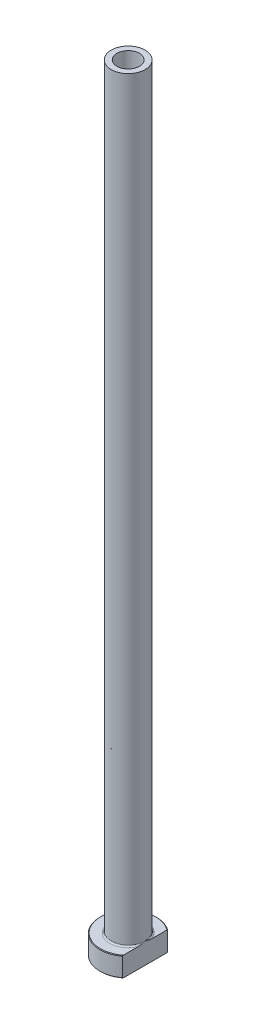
ISO-10303-21;
HEADER;
FILE_DESCRIPTION(('STEP AP214'),'2;1');
FILE_NAME('part.step','',(''),(''),'','','');
FILE_SCHEMA(('AUTOMOTIVE_DESIGN { 1 0 10303 214 1 1 1 1 }'));
ENDSEC;
DATA;
#1=APPLICATION_CONTEXT('core data for automotive mechanical design processes');
#2=APPLICATION_PROTOCOL_DEFINITION('international standard','automotive_design',2000,#1);
#3=PRODUCT_CONTEXT('',#1,'mechanical');
#4=PRODUCT('Part','Part','',(#3));
#5=PRODUCT_RELATED_PRODUCT_CATEGORY('part','',(#4));
#6=PRODUCT_DEFINITION_FORMATION('','',#4);
#7=PRODUCT_DEFINITION_CONTEXT('part definition',#1,'design');
#8=PRODUCT_DEFINITION('design','',#6,#7);
#9=PRODUCT_DEFINITION_SHAPE('','',#8);
#10=(LENGTH_UNIT() NAMED_UNIT(*) SI_UNIT(.MILLI.,.METRE.));
#11=(NAMED_UNIT(*) PLANE_ANGLE_UNIT() SI_UNIT($,.RADIAN.));
#12=(NAMED_UNIT(*) SI_UNIT($,.STERADIAN.) SOLID_ANGLE_UNIT());
#13=UNCERTAINTY_MEASURE_WITH_UNIT(LENGTH_MEASURE(1.E-05),#10,'distance_accuracy_value','');
#14=(GEOMETRIC_REPRESENTATION_CONTEXT(3) GLOBAL_UNCERTAINTY_ASSIGNED_CONTEXT((#13)) GLOBAL_UNIT_ASSIGNED_CONTEXT((#10,
#11,#12)) REPRESENTATION_CONTEXT('',''));
#15=CARTESIAN_POINT('',(0.,0.,0.));
#16=DIRECTION('',(0.,0.,1.));
#17=DIRECTION('',(1.,0.,0.));
#18=AXIS2_PLACEMENT_3D('',#15,#16,#17);
#19=CARTESIAN_POINT('',(0.,92.1876809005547,0.));
#20=DIRECTION('',(0.,1.,0.));
#21=DIRECTION('',(0.,0.,1.));
#22=AXIS2_PLACEMENT_3D('',#19,#20,#21);
#23=CYLINDRICAL_SURFACE('',#22,4.00000000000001);
#24=CARTESIAN_POINT('',(0.,275.,0.));
#25=DIRECTION('',(0.,1.,0.));
#26=DIRECTION('',(0.,0.,1.));
#27=AXIS2_PLACEMENT_3D('',#24,#25,#26);
#28=CIRCLE('',#27,4.00000000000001);
#29=CARTESIAN_POINT('',(0.,275.,4.00000000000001));
#30=VERTEX_POINT('',#29);
#31=EDGE_CURVE('E167',#30,#30,#28,.T.);
#32=ORIENTED_EDGE('',*,*,#31,.T.);
#33=EDGE_LOOP('',(#32));
#34=FACE_BOUND('',#33,.T.);
#35=CARTESIAN_POINT('',(0.,230.,0.));
#36=DIRECTION('',(0.,1.,0.));
#37=DIRECTION('',(0.,0.,1.));
#38=AXIS2_PLACEMENT_3D('',#35,#36,#37);
#39=CIRCLE('',#38,4.00000000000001);
#40=CARTESIAN_POINT('',(0.,230.,4.00000000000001));
#41=VERTEX_POINT('',#40);
#42=EDGE_CURVE('E170',#41,#41,#39,.T.);
#43=ORIENTED_EDGE('',*,*,#42,.F.);
#44=EDGE_LOOP('',(#43));
#45=FACE_BOUND('',#44,.T.);
#46=ADVANCED_FACE('F32',(#34,#45),#23,.F.);
#47=CARTESIAN_POINT('',(-4.00000000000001,275.,0.));
#48=DIRECTION('',(0.,1.,0.));
#49=DIRECTION('',(0.,0.,1.));
#50=AXIS2_PLACEMENT_3D('',#47,#48,#49);
#51=PLANE('',#50);
#52=CARTESIAN_POINT('',(0.,275.,0.));
#53=DIRECTION('',(0.,1.,0.));
#54=DIRECTION('',(0.,0.,1.));
#55=AXIS2_PLACEMENT_3D('',#52,#53,#54);
#56=CIRCLE('',#55,6.00000000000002);
#57=CARTESIAN_POINT('',(0.,275.,6.00000000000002));
#58=VERTEX_POINT('',#57);
#59=EDGE_CURVE('E174',#58,#58,#56,.T.);
#60=ORIENTED_EDGE('',*,*,#59,.T.);
#61=EDGE_LOOP('',(#60));
#62=FACE_BOUND('',#61,.T.);
#63=ORIENTED_EDGE('',*,*,#31,.F.);
#64=EDGE_LOOP('',(#63));
#65=FACE_BOUND('',#64,.T.);
#66=ADVANCED_FACE('F157',(#62,#65),#51,.T.);
#67=CARTESIAN_POINT('',(0.,92.1876809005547,0.));
#68=DIRECTION('',(0.,1.,0.));
#69=DIRECTION('',(0.,0.,1.));
#70=AXIS2_PLACEMENT_3D('',#67,#68,#69);
#71=CYLINDRICAL_SURFACE('',#70,6.00000000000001);
#72=CARTESIAN_POINT('',(0.,7.50000000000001,0.));
#73=DIRECTION('',(0.,1.,0.));
#74=DIRECTION('',(0.,0.,1.));
#75=AXIS2_PLACEMENT_3D('',#72,#73,#74);
#76=CIRCLE('',#75,6.00000000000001);
#77=CARTESIAN_POINT('',(6.,7.50000000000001,0.));
#78=VERTEX_POINT('',#77);
#79=EDGE_CURVE('E180',#78,#78,#76,.T.);
#80=ORIENTED_EDGE('',*,*,#79,.T.);
#81=EDGE_LOOP('',(#80));
#82=FACE_BOUND('',#81,.T.);
#83=ORIENTED_EDGE('',*,*,#59,.F.);
#84=EDGE_LOOP('',(#83));
#85=FACE_BOUND('',#84,.T.);
#86=ADVANCED_FACE('F162',(#82,#85),#71,.T.);
#87=CARTESIAN_POINT('',(-5.99999999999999,7.,0.));
#88=DIRECTION('',(0.,1.,0.));
#89=DIRECTION('',(0.,0.,1.));
#90=AXIS2_PLACEMENT_3D('',#87,#88,#89);
#91=PLANE('',#90);
#92=DIRECTION('',(0.,0.,1.));
#93=VECTOR('',#92,1.);
#94=CARTESIAN_POINT('',(6.,7.,0.));
#95=LINE('',#94,#93);
#96=CARTESIAN_POINT('',(6.,7.,-7.74854825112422));
#97=VERTEX_POINT('',#96);
#98=CARTESIAN_POINT('',(6.,7.,-2.50000000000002));
#99=VERTEX_POINT('',#98);
#100=EDGE_CURVE('E54',#97,#99,#95,.T.);
#101=ORIENTED_EDGE('',*,*,#100,.F.);
#102=CARTESIAN_POINT('',(0.,7.,0.));
#103=DIRECTION('',(0.,1.,0.));
#104=DIRECTION('',(0.,0.,1.));
#105=AXIS2_PLACEMENT_3D('',#102,#103,#104);
#106=CIRCLE('',#105,9.80000000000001);
#107=CARTESIAN_POINT('',(5.99999999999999,7.,7.74854825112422));
#108=VERTEX_POINT('',#107);
#109=EDGE_CURVE('E186',#97,#108,#106,.T.);
#110=ORIENTED_EDGE('',*,*,#109,.T.);
#111=CARTESIAN_POINT('',(6.,7.,2.50000000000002));
#112=VERTEX_POINT('',#111);
#113=EDGE_CURVE('E134',#112,#108,#95,.T.);
#114=ORIENTED_EDGE('',*,*,#113,.F.);
#115=CARTESIAN_POINT('',(0.,7.,0.));
#116=DIRECTION('',(0.,1.,0.));
#117=DIRECTION('',(0.,0.,1.));
#118=AXIS2_PLACEMENT_3D('',#115,#116,#117);
#119=CIRCLE('',#118,6.50000000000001);
#120=EDGE_CURVE('E183',#112,#99,#119,.F.);
#121=ORIENTED_EDGE('',*,*,#120,.T.);
#122=EDGE_LOOP('',(#101,#110,#114,#121));
#123=FACE_BOUND('',#122,.T.);
#124=ADVANCED_FACE('F197',(#123),#91,.T.);
#125=CARTESIAN_POINT('',(0.,92.1876809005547,0.));
#126=DIRECTION('',(0.,1.,0.));
#127=DIRECTION('',(0.,0.,1.));
#128=AXIS2_PLACEMENT_3D('',#125,#126,#127);
#129=CYLINDRICAL_SURFACE('',#128,9.99999999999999);
#130=DIRECTION('',(0.,-1.,0.));
#131=VECTOR('',#130,1.);
#132=CARTESIAN_POINT('',(5.99999999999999,275.,7.99999999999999));
#133=LINE('',#132,#131);
#134=CARTESIAN_POINT('',(5.99999999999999,6.80000000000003,7.99999999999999));
#135=VERTEX_POINT('',#134);
#136=CARTESIAN_POINT('',(5.99999999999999,0.200000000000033,7.99999999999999));
#137=VERTEX_POINT('',#136);
#138=EDGE_CURVE('E82',#135,#137,#133,.T.);
#139=ORIENTED_EDGE('',*,*,#138,.F.);
#140=CARTESIAN_POINT('',(0.,6.80000000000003,0.));
#141=DIRECTION('',(0.,1.,0.));
#142=DIRECTION('',(0.,0.,1.));
#143=AXIS2_PLACEMENT_3D('',#140,#141,#142);
#144=CIRCLE('',#143,9.99999999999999);
#145=CARTESIAN_POINT('',(6.,6.80000000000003,-7.99999999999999));
#146=VERTEX_POINT('',#145);
#147=EDGE_CURVE('E95',#135,#146,#144,.F.);
#148=ORIENTED_EDGE('',*,*,#147,.T.);
#149=DIRECTION('',(0.,-1.,0.));
#150=VECTOR('',#149,1.);
#151=CARTESIAN_POINT('',(6.,275.,-7.99999999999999));
#152=LINE('',#151,#150);
#153=CARTESIAN_POINT('',(6.,0.200000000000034,-7.99999999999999));
#154=VERTEX_POINT('',#153);
#155=EDGE_CURVE('E192',#146,#154,#152,.T.);
#156=ORIENTED_EDGE('',*,*,#155,.T.);
#157=CARTESIAN_POINT('',(0.,0.200000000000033,0.));
#158=DIRECTION('',(0.,-1.,0.));
#159=DIRECTION('',(0.,0.,-1.));
#160=AXIS2_PLACEMENT_3D('',#157,#158,#159);
#161=CIRCLE('',#160,9.99999999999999);
#162=EDGE_CURVE('E98',#154,#137,#161,.F.);
#163=ORIENTED_EDGE('',*,*,#162,.T.);
#164=EDGE_LOOP('',(#139,#148,#156,#163));
#165=FACE_BOUND('',#164,.T.);
#166=ADVANCED_FACE('F190',(#165),#129,.T.);
#167=CARTESIAN_POINT('',(-9.99999999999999,0.,0.));
#168=DIRECTION('',(0.,-1.,0.));
#169=DIRECTION('',(0.,0.,-1.));
#170=AXIS2_PLACEMENT_3D('',#167,#168,#169);
#171=PLANE('',#170);
#172=CARTESIAN_POINT('',(0.,0.,0.));
#173=DIRECTION('',(0.,-1.,0.));
#174=DIRECTION('',(0.,0.,-1.));
#175=AXIS2_PLACEMENT_3D('',#172,#173,#174);
#176=CIRCLE('',#175,4.75);
#177=CARTESIAN_POINT('',(0.,0.,-4.75));
#178=VERTEX_POINT('',#177);
#179=EDGE_CURVE('E40',#178,#178,#176,.F.);
#180=ORIENTED_EDGE('',*,*,#179,.T.);
#181=EDGE_LOOP('',(#180));
#182=FACE_BOUND('',#181,.T.);
#183=DIRECTION('',(0.,0.,-1.));
#184=VECTOR('',#183,1.);
#185=CARTESIAN_POINT('',(5.99999999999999,0.,7.99999999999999));
#186=LINE('',#185,#184);
#187=CARTESIAN_POINT('',(5.99999999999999,0.,7.74854825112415));
#188=VERTEX_POINT('',#187);
#189=CARTESIAN_POINT('',(6.,0.,-7.74854825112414));
#190=VERTEX_POINT('',#189);
#191=EDGE_CURVE('E47',#188,#190,#186,.T.);
#192=ORIENTED_EDGE('',*,*,#191,.F.);
#193=CARTESIAN_POINT('',(0.,0.,0.));
#194=DIRECTION('',(0.,-1.,0.));
#195=DIRECTION('',(0.,0.,-1.));
#196=AXIS2_PLACEMENT_3D('',#193,#194,#195);
#197=CIRCLE('',#196,9.79999999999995);
#198=EDGE_CURVE('E92',#188,#190,#197,.T.);
#199=ORIENTED_EDGE('',*,*,#198,.T.);
#200=EDGE_LOOP('',(#192,#199));
#201=FACE_BOUND('',#200,.T.);
#202=ADVANCED_FACE('F91',(#182,#201),#171,.T.);
#203=CARTESIAN_POINT('',(0.,92.1876809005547,0.));
#204=DIRECTION('',(0.,1.,0.));
#205=DIRECTION('',(0.,0.,1.));
#206=AXIS2_PLACEMENT_3D('',#203,#204,#205);
#207=CYLINDRICAL_SURFACE('',#206,4.25);
#208=CARTESIAN_POINT('',(0.,0.499999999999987,0.));
#209=DIRECTION('',(0.,-1.,0.));
#210=DIRECTION('',(0.,0.,-1.));
#211=AXIS2_PLACEMENT_3D('',#208,#209,#210);
#212=CIRCLE('',#211,4.25);
#213=CARTESIAN_POINT('',(0.,0.499999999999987,-4.25));
#214=VERTEX_POINT('',#213);
#215=EDGE_CURVE('E11',#214,#214,#212,.T.);
#216=ORIENTED_EDGE('',*,*,#215,.T.);
#217=EDGE_LOOP('',(#216));
#218=FACE_BOUND('',#217,.T.);
#219=CARTESIAN_POINT('',(0.,218.,0.));
#220=DIRECTION('',(0.,1.,0.));
#221=DIRECTION('',(0.,0.,1.));
#222=AXIS2_PLACEMENT_3D('',#219,#220,#221);
#223=CIRCLE('',#222,4.25000000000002);
#224=CARTESIAN_POINT('',(0.,218.,4.25000000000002));
#225=VERTEX_POINT('',#224);
#226=EDGE_CURVE('E172',#225,#225,#223,.T.);
#227=ORIENTED_EDGE('',*,*,#226,.T.);
#228=EDGE_LOOP('',(#227));
#229=FACE_BOUND('',#228,.T.);
#230=ADVANCED_FACE('F215',(#218,#229),#207,.F.);
#231=CARTESIAN_POINT('',(0.,218.,0.));
#232=DIRECTION('',(0.,-1.,0.));
#233=DIRECTION('',(0.,0.,-1.));
#234=AXIS2_PLACEMENT_3D('',#231,#232,#233);
#235=CONICAL_SURFACE('',#234,4.25000000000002,0.0208303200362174);
#236=ORIENTED_EDGE('',*,*,#42,.T.);
#237=EDGE_LOOP('',(#236));
#238=FACE_BOUND('',#237,.T.);
#239=ORIENTED_EDGE('',*,*,#226,.F.);
#240=EDGE_LOOP('',(#239));
#241=FACE_BOUND('',#240,.T.);
#242=ADVANCED_FACE('F111',(#238,#241),#235,.F.);
#243=CARTESIAN_POINT('',(0.,7.50000000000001,0.));
#244=DIRECTION('',(0.,1.,0.));
#245=DIRECTION('',(0.,0.,1.));
#246=AXIS2_PLACEMENT_3D('',#243,#244,#245);
#247=TOROIDAL_SURFACE('',#246,6.50000000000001,0.5);
#248=ORIENTED_EDGE('',*,*,#120,.F.);
#249=CARTESIAN_POINT('',(6.,7.50000000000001,0.));
#250=CARTESIAN_POINT('',(6.,7.50000080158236,6.70589102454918E-11));
#251=CARTESIAN_POINT('',(6.,7.50000160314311,2.62462821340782E-07));
#252=CARTESIAN_POINT('',(6.,7.50000311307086,1.01907222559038E-06));
#253=CARTESIAN_POINT('',(6.,7.50000381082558,1.52837970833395E-06));
#254=CARTESIAN_POINT('',(6.,7.50000523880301,2.74467673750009E-06));
#255=CARTESIAN_POINT('',(6.,7.50000595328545,3.47066796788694E-06));
#256=CARTESIAN_POINT('',(6.,7.50000725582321,4.99336266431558E-06));
#257=CARTESIAN_POINT('',(6.,7.50000784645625,5.7880020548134E-06));
#258=CARTESIAN_POINT('',(6.,7.50000997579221,8.79661715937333E-06));
#259=CARTESIAN_POINT('',(6.,7.50001139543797,1.10980689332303E-05));
#260=CARTESIAN_POINT('',(6.,7.50001378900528,1.57116113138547E-05));
#261=CARTESIAN_POINT('',(6.,7.50001478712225,1.80117459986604E-05));
#262=CARTESIAN_POINT('',(6.,7.50001885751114,2.75423866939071E-05));
#263=CARTESIAN_POINT('',(6.,7.50002181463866,3.48285119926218E-05));
#264=CARTESIAN_POINT('',(6.,7.50002628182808,4.87408443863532E-05));
#265=CARTESIAN_POINT('',(6.,7.5000279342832,5.53214425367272E-05));
#266=CARTESIAN_POINT('',(6.,7.50003978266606,0.000103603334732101));
#267=CARTESIAN_POINT('',(6.,7.50004857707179,0.000145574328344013));
#268=CARTESIAN_POINT('',(5.99999999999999,7.50008704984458,0.00031069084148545));
#269=CARTESIAN_POINT('',(5.99999999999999,7.50012394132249,0.000432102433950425));
#270=CARTESIAN_POINT('',(6.,7.50026686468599,0.000911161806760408));
#271=CARTESIAN_POINT('',(6.,7.50036807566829,0.00126981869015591));
#272=CARTESIAN_POINT('',(5.99999999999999,7.5007719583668,0.00268961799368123));
#273=CARTESIAN_POINT('',(5.99999999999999,7.5010805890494,0.00374948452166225));
#274=CARTESIAN_POINT('',(6.,7.50236320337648,0.00816658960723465));
#275=CARTESIAN_POINT('',(6.,7.5033297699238,0.0115254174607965));
#276=CARTESIAN_POINT('',(5.99999999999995,7.51709821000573,0.0593544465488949));
#277=CARTESIAN_POINT('',(5.99999999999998,7.52995465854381,0.103813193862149));
#278=CARTESIAN_POINT('',(6.00000000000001,7.55506029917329,0.190977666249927));
#279=CARTESIAN_POINT('',(6.,7.56731321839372,0.233682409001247));
#280=CARTESIAN_POINT('',(5.99999999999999,7.59325665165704,0.32451250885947));
#281=CARTESIAN_POINT('',(5.99999999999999,7.60693346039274,0.372641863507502));
#282=CARTESIAN_POINT('',(6.,7.63422038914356,0.469489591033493));
#283=CARTESIAN_POINT('',(6.,7.64782813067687,0.518208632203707));
#284=CARTESIAN_POINT('',(6.,7.68043734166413,0.636338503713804));
#285=CARTESIAN_POINT('',(6.,7.69928754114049,0.705791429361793));
#286=CARTESIAN_POINT('',(6.,7.73566887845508,0.84310273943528));
#287=CARTESIAN_POINT('',(6.,7.75322160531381,0.910955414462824));
#288=CARTESIAN_POINT('',(6.,7.80024878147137,1.09857433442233));
#289=CARTESIAN_POINT('',(6.,7.82864900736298,1.21861610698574));
#290=CARTESIAN_POINT('',(6.,7.88105633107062,1.46081534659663));
#291=CARTESIAN_POINT('',(6.,7.90502088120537,1.58298212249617));
#292=CARTESIAN_POINT('',(6.,7.94810499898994,1.83866408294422));
#293=CARTESIAN_POINT('',(6.,7.96665856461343,1.9722808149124));
#294=CARTESIAN_POINT('',(6.,7.9862169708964,2.17329578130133));
#295=CARTESIAN_POINT('',(6.,7.99135613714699,2.24029152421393));
#296=CARTESIAN_POINT('',(6.,7.99832928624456,2.37444824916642));
#297=CARTESIAN_POINT('',(6.,8.00016429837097,2.4416091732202));
#298=CARTESIAN_POINT('',(6.,7.99984674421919,2.56298631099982));
#299=CARTESIAN_POINT('',(6.,7.99839439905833,2.61720324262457));
#300=CARTESIAN_POINT('',(6.,7.99236557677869,2.72552036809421));
#301=CARTESIAN_POINT('',(6.,7.98778645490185,2.77962042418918));
#302=CARTESIAN_POINT('',(6.,7.97492915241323,2.88664710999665));
#303=CARTESIAN_POINT('',(6.,7.96670262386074,2.93957965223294));
#304=CARTESIAN_POINT('',(6.,7.94570253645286,3.04448333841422));
#305=CARTESIAN_POINT('',(6.,7.93293488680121,3.09645563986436));
#306=CARTESIAN_POINT('',(6.,7.90135968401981,3.19943606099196));
#307=CARTESIAN_POINT('',(6.,7.8824717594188,3.25042120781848));
#308=CARTESIAN_POINT('',(6.,7.84818685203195,3.3240378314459));
#309=CARTESIAN_POINT('',(6.,7.8357905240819,3.34806431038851));
#310=CARTESIAN_POINT('',(6.,7.80866016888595,3.39474488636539));
#311=CARTESIAN_POINT('',(6.,7.79392968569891,3.41740099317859));
#312=CARTESIAN_POINT('',(6.,7.76577135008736,3.45524173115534));
#313=CARTESIAN_POINT('',(6.,7.75294719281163,3.47087266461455));
#314=CARTESIAN_POINT('',(6.,7.7255631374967,3.50058040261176));
#315=CARTESIAN_POINT('',(6.,7.71100204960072,3.5146561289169));
#316=CARTESIAN_POINT('',(6.,7.67984897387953,3.54077006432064));
#317=CARTESIAN_POINT('',(6.,7.66323651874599,3.55278430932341));
#318=CARTESIAN_POINT('',(6.,7.62815222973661,3.57370259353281));
#319=CARTESIAN_POINT('',(6.,7.60968501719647,3.58261412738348));
#320=CARTESIAN_POINT('',(6.,7.57639898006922,3.59454653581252));
#321=CARTESIAN_POINT('',(6.,7.56191673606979,3.59850385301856));
#322=CARTESIAN_POINT('',(6.,7.53249228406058,3.60392336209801));
#323=CARTESIAN_POINT('',(6.,7.51755044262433,3.60538749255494));
#324=CARTESIAN_POINT('',(6.,7.48761833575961,3.60568912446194));
#325=CARTESIAN_POINT('',(6.,7.47262803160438,3.60452285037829));
#326=CARTESIAN_POINT('',(6.,7.44306278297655,3.59966500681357));
#327=CARTESIAN_POINT('',(6.,7.42848812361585,3.59597174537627));
#328=CARTESIAN_POINT('',(6.,7.3970215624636,3.58531109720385));
#329=CARTESIAN_POINT('',(6.,7.38031267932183,3.5778073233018));
#330=CARTESIAN_POINT('',(6.,7.34834450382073,3.56018434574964));
#331=CARTESIAN_POINT('',(6.,7.33308764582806,3.55006085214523));
#332=CARTESIAN_POINT('',(6.,7.29715308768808,3.52252389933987));
#333=CARTESIAN_POINT('',(6.,7.27737832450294,3.50394102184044));
#334=CARTESIAN_POINT('',(6.,7.24088410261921,3.46399503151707));
#335=CARTESIAN_POINT('',(6.,7.22417302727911,3.44262455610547));
#336=CARTESIAN_POINT('',(6.,7.18148338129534,3.38088102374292));
#337=CARTESIAN_POINT('',(6.,7.15831783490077,3.33858120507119));
#338=CARTESIAN_POINT('',(6.,7.11822747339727,3.25128083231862));
#339=CARTESIAN_POINT('',(6.,7.10130560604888,3.20627901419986));
#340=CARTESIAN_POINT('',(6.,7.07193388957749,3.11375892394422));
#341=CARTESIAN_POINT('',(6.,7.05959256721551,3.06620687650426));
#342=CARTESIAN_POINT('',(6.,7.03888782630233,2.97022063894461));
#343=CARTESIAN_POINT('',(6.,7.03052890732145,2.92178551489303));
#344=CARTESIAN_POINT('',(6.,7.01697563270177,2.8237457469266));
#345=CARTESIAN_POINT('',(6.,7.01183067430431,2.77413446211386));
#346=CARTESIAN_POINT('',(6.,7.00435015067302,2.67475263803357));
#347=CARTESIAN_POINT('',(6.,7.00201229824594,2.62498226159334));
#348=CARTESIAN_POINT('',(6.,6.9989719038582,2.49377014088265));
#349=CARTESIAN_POINT('',(6.,7.00025005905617,2.41228296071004));
#350=CARTESIAN_POINT('',(6.,7.0077565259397,2.24952135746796));
#351=CARTESIAN_POINT('',(6.,7.01398784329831,2.16824709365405));
#352=CARTESIAN_POINT('',(6.,7.03045087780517,2.00575531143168));
#353=CARTESIAN_POINT('',(6.,7.04070001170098,1.92453960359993));
#354=CARTESIAN_POINT('',(6.,7.06442774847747,1.76257601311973));
#355=CARTESIAN_POINT('',(6.,7.07790697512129,1.68182822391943));
#356=CARTESIAN_POINT('',(6.,7.11973611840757,1.4539431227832));
#357=CARTESIAN_POINT('',(6.,7.15113840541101,1.30736987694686));
#358=CARTESIAN_POINT('',(6.,7.21927147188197,1.01717316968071));
#359=CARTESIAN_POINT('',(6.,7.25594155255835,0.873534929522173));
#360=CARTESIAN_POINT('',(6.,7.30765759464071,0.680321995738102));
#361=CARTESIAN_POINT('',(6.,7.32124979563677,0.630351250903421));
#362=CARTESIAN_POINT('',(6.,7.34913735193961,0.529103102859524));
#363=CARTESIAN_POINT('',(6.,7.36344174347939,0.477828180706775));
#364=CARTESIAN_POINT('',(6.,7.38809313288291,0.390268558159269));
#365=CARTESIAN_POINT('',(6.,7.39837954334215,0.353966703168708));
#366=CARTESIAN_POINT('',(6.,7.41893445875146,0.281778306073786));
#367=CARTESIAN_POINT('',(6.,7.42920197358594,0.245891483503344));
#368=CARTESIAN_POINT('',(5.99999999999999,7.4486400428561,0.178137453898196));
#369=CARTESIAN_POINT('',(5.99999999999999,7.45780513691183,0.14626862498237));
#370=CARTESIAN_POINT('',(6.,7.47656016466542,0.0812304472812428));
#371=CARTESIAN_POINT('',(6.00000000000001,7.48615204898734,0.0480615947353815));
#372=CARTESIAN_POINT('',(5.99999999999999,7.4966696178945,0.0115277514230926));
#373=CARTESIAN_POINT('',(5.99999999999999,7.49763547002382,0.00817123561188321));
#374=CARTESIAN_POINT('',(6.,7.49891791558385,0.00375466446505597));
#375=CARTESIAN_POINT('',(6.,7.49922706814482,0.00269301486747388));
#376=CARTESIAN_POINT('',(5.99999999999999,7.49963158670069,0.00127098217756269));
#377=CARTESIAN_POINT('',(5.99999999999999,7.49973292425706,0.000911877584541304));
#378=CARTESIAN_POINT('',(6.,7.49987600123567,0.000432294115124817));
#379=CARTESIAN_POINT('',(6.,7.49991291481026,0.000310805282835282));
#380=CARTESIAN_POINT('',(5.99999999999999,7.49995140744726,0.00014559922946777));
#381=CARTESIAN_POINT('',(5.99999999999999,7.49996020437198,0.000103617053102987));
#382=CARTESIAN_POINT('',(6.,7.49997205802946,5.53238244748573E-05));
#383=CARTESIAN_POINT('',(6.,7.49997371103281,4.87425723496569E-05));
#384=CARTESIAN_POINT('',(6.,7.49997817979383,3.48289280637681E-05));
#385=CARTESIAN_POINT('',(6.,7.49998113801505,2.75421791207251E-05));
#386=CARTESIAN_POINT('',(6.,7.49998520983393,1.80109018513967E-05));
#387=CARTESIAN_POINT('',(6.,7.49998620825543,1.57107180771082E-05));
#388=CARTESIAN_POINT('',(6.,7.49998860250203,1.10971303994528E-05));
#389=CARTESIAN_POINT('',(6.,7.49999002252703,8.79568794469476E-06));
#390=CARTESIAN_POINT('',(6.,7.49999215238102,5.78714778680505E-06));
#391=CARTESIAN_POINT('',(6.,7.49999274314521,4.9925443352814E-06));
#392=CARTESIAN_POINT('',(6.,7.49999404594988,3.46994517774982E-06));
#393=CARTESIAN_POINT('',(6.,7.49999476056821,2.74401420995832E-06));
#394=CARTESIAN_POINT('',(6.,7.49999618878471,1.52786018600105E-06));
#395=CARTESIAN_POINT('',(6.,7.49999688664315,1.01863063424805E-06));
#396=CARTESIAN_POINT('',(6.,7.49999839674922,2.6221568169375E-07));
#397=CARTESIAN_POINT('',(6.,7.49999919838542,-6.70603058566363E-11));
#398=CARTESIAN_POINT('',(6.,7.50000000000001,0.));
#399=B_SPLINE_CURVE_WITH_KNOTS('',3,(#249,#250,#251,#252,#253,#254,#255,#256,#257,#258,#259,
#260,#261,#262,#263,#264,#265,#266,#267,#268,#269,#270,#271,#272,#273,#274,#275,#276,#277,#278,
#279,#280,#281,#282,#283,#284,#285,#286,#287,#288,#289,#290,#291,#292,#293,#294,#295,#296,#297,
#298,#299,#300,#301,#302,#303,#304,#305,#306,#307,#308,#309,#310,#311,#312,#313,#314,#315,#316,
#317,#318,#319,#320,#321,#322,#323,#324,#325,#326,#327,#328,#329,#330,#331,#332,#333,#334,#335,
#336,#337,#338,#339,#340,#341,#342,#343,#344,#345,#346,#347,#348,#349,#350,#351,#352,#353,#354,
#355,#356,#357,#358,#359,#360,#361,#362,#363,#364,#365,#366,#367,#368,#369,#370,#371,#372,#373,
#374,#375,#376,#377,#378,#379,#380,#381,#382,#383,#384,#385,#386,#387,#388,#389,#390,#391,#392,
#393,#394,#395,#396,#397,#398),.UNSPECIFIED.,.T.,.F.,(4,2,2,2,2,2,2,2,2,2,2,2,2,2,2,2,2,2,2,2,2,
2,2,2,2,2,2,2,2,2,2,2,2,2,2,2,2,2,2,2,2,2,2,2,2,2,2,2,2,2,2,2,2,2,2,2,2,2,2,2,2,2,2,2,2,2,2,2,2,
2,2,2,2,2,4),(0.,2.41532791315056E-06,5.00161675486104E-06,8.04115813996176E-06,
1.10092294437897E-05,1.90889719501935E-05,2.66047346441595E-05,5.01454053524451E-05,
7.04739991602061E-05,0.000199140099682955,0.000579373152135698,0.00169781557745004,
0.00500893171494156,0.0154949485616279,0.154330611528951,0.287615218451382,0.437719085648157,
0.589470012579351,0.805361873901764,1.01561737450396,1.38561400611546,1.75899405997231,
2.16331287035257,2.3648290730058,2.56628249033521,2.72891861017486,2.89169246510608,
3.05223140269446,3.21256219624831,3.37509011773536,3.45609970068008,3.53698744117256,
3.59753760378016,3.65812948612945,3.71938396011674,3.7804894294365,3.82533702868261,
3.87014974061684,3.91502681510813,3.95993396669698,4.0145809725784,4.06931803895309,
4.15026803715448,4.23143634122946,4.37530581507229,4.51924312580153,4.66640085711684,
4.81372446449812,4.96325999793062,5.11267360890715,5.35695170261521,5.60137814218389,
5.84687607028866,6.09242144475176,6.54191534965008,6.98659302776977,7.14195169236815,
7.30164895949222,7.4148422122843,7.52682205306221,7.62630458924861,7.72988447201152,
7.74036324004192,7.743679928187,7.74479976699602,7.74518024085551,7.74530894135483,
7.74532927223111,7.74535281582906,7.7453603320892,7.7453684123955,7.74537138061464,
7.74537442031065,7.74537700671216,7.7453794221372),.UNSPECIFIED.);
#400=EDGE_CURVE('E126',#112,#78,#399,.T.);
#401=ORIENTED_EDGE('',*,*,#400,.T.);
#402=ORIENTED_EDGE('',*,*,#79,.F.);
#403=CARTESIAN_POINT('',(6.,7.50000000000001,0.));
#404=CARTESIAN_POINT('',(6.,7.49999919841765,-6.70573124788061E-11));
#405=CARTESIAN_POINT('',(6.,7.4999983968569,-2.62462819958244E-07));
#406=CARTESIAN_POINT('',(6.,7.49999688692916,-1.01907222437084E-06));
#407=CARTESIAN_POINT('',(6.,7.49999618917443,-1.52837970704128E-06));
#408=CARTESIAN_POINT('',(6.,7.499994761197,-2.74467673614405E-06));
#409=CARTESIAN_POINT('',(6.,7.49999404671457,-3.47066796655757E-06));
#410=CARTESIAN_POINT('',(6.,7.4999927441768,-4.99336266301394E-06));
#411=CARTESIAN_POINT('',(6.,7.49999215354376,-5.78800205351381E-06));
#412=CARTESIAN_POINT('',(6.,7.4999900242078,-8.79661715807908E-06));
#413=CARTESIAN_POINT('',(6.,7.49998860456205,-1.10980689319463E-05));
#414=CARTESIAN_POINT('',(6.,7.49998621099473,-1.57116113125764E-05));
#415=CARTESIAN_POINT('',(6.,7.49998521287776,-1.80117459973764E-05));
#416=CARTESIAN_POINT('',(6.,7.49998114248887,-2.75423866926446E-05));
#417=CARTESIAN_POINT('',(6.,7.49997818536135,-3.48285119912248E-05));
#418=CARTESIAN_POINT('',(6.,7.49997371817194,-4.87408443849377E-05));
#419=CARTESIAN_POINT('',(6.,7.49997206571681,-5.53214425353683E-05));
#420=CARTESIAN_POINT('',(5.99999999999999,7.49996021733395,-0.000103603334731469));
#421=CARTESIAN_POINT('',(5.99999999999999,7.49995142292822,-0.00014557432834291));
#422=CARTESIAN_POINT('',(6.,7.49991295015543,-0.000310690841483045));
#423=CARTESIAN_POINT('',(6.,7.49987605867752,-0.000432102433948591));
#424=CARTESIAN_POINT('',(5.99999999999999,7.49973313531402,-0.000911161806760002));
#425=CARTESIAN_POINT('',(5.99999999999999,7.49963192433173,-0.00126981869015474));
#426=CARTESIAN_POINT('',(6.,7.49922804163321,-0.00268961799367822));
#427=CARTESIAN_POINT('',(6.,7.49891941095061,-0.00374948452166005));
#428=CARTESIAN_POINT('',(5.99999999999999,7.49763679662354,-0.00816658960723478));
#429=CARTESIAN_POINT('',(5.99999999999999,7.49667023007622,-0.0115254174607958));
#430=CARTESIAN_POINT('',(6.00000000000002,7.48290178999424,-0.0593544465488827));
#431=CARTESIAN_POINT('',(6.,7.4700453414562,-0.103813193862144));
#432=CARTESIAN_POINT('',(5.99999999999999,7.44493970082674,-0.190977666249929));
#433=CARTESIAN_POINT('',(5.99999999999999,7.4326867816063,-0.233682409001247));
#434=CARTESIAN_POINT('',(6.,7.40674334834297,-0.32451250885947));
#435=CARTESIAN_POINT('',(6.,7.39306653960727,-0.372641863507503));
#436=CARTESIAN_POINT('',(6.,7.36577961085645,-0.469489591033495));
#437=CARTESIAN_POINT('',(6.,7.35217186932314,-0.518208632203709));
#438=CARTESIAN_POINT('',(6.,7.31956265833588,-0.636338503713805));
#439=CARTESIAN_POINT('',(6.,7.30071245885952,-0.705791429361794));
#440=CARTESIAN_POINT('',(6.,7.26433112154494,-0.84310273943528));
#441=CARTESIAN_POINT('',(6.,7.2467783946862,-0.910955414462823));
#442=CARTESIAN_POINT('',(6.,7.19975121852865,-1.09857433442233));
#443=CARTESIAN_POINT('',(6.,7.17135099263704,-1.21861610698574));
#444=CARTESIAN_POINT('',(6.,7.11894366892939,-1.46081534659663));
#445=CARTESIAN_POINT('',(6.,7.09497911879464,-1.58298212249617));
#446=CARTESIAN_POINT('',(6.,7.05189500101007,-1.83866408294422));
#447=CARTESIAN_POINT('',(6.,7.03334143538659,-1.9722808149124));
#448=CARTESIAN_POINT('',(6.,7.01378302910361,-2.17329578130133));
#449=CARTESIAN_POINT('',(6.,7.00864386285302,-2.24029152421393));
#450=CARTESIAN_POINT('',(6.,7.00167071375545,-2.37444824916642));
#451=CARTESIAN_POINT('',(6.,6.99983570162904,-2.4416091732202));
#452=CARTESIAN_POINT('',(6.,7.00015325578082,-2.56298631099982));
#453=CARTESIAN_POINT('',(6.,7.00160560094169,-2.61720324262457));
#454=CARTESIAN_POINT('',(6.,7.00763442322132,-2.72552036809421));
#455=CARTESIAN_POINT('',(6.,7.01221354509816,-2.77962042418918));
#456=CARTESIAN_POINT('',(6.,7.02507084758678,-2.88664710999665));
#457=CARTESIAN_POINT('',(6.,7.03329737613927,-2.93957965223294));
#458=CARTESIAN_POINT('',(6.,7.05429746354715,-3.04448333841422));
#459=CARTESIAN_POINT('',(6.,7.06706511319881,-3.09645563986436));
#460=CARTESIAN_POINT('',(6.,7.0986403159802,-3.19943606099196));
#461=CARTESIAN_POINT('',(6.,7.11752824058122,-3.25042120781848));
#462=CARTESIAN_POINT('',(6.,7.15181314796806,-3.32403783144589));
#463=CARTESIAN_POINT('',(6.,7.16420947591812,-3.34806431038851));
#464=CARTESIAN_POINT('',(6.,7.19133983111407,-3.39474488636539));
#465=CARTESIAN_POINT('',(6.,7.2060703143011,-3.41740099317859));
#466=CARTESIAN_POINT('',(6.,7.23422864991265,-3.45524173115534));
#467=CARTESIAN_POINT('',(6.,7.24705280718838,-3.47087266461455));
#468=CARTESIAN_POINT('',(6.,7.27443686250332,-3.50058040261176));
#469=CARTESIAN_POINT('',(6.,7.2889979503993,-3.5146561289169));
#470=CARTESIAN_POINT('',(6.,7.32015102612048,-3.54077006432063));
#471=CARTESIAN_POINT('',(6.,7.33676348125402,-3.55278430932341));
#472=CARTESIAN_POINT('',(6.,7.3718477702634,-3.5737025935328));
#473=CARTESIAN_POINT('',(6.,7.39031498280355,-3.58261412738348));
#474=CARTESIAN_POINT('',(6.,7.42360101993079,-3.59454653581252));
#475=CARTESIAN_POINT('',(6.,7.43808326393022,-3.59850385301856));
#476=CARTESIAN_POINT('',(6.,7.46750771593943,-3.60392336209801));
#477=CARTESIAN_POINT('',(6.,7.48244955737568,-3.60538749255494));
#478=CARTESIAN_POINT('',(6.,7.5123816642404,-3.60568912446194));
#479=CARTESIAN_POINT('',(6.,7.52737196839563,-3.60452285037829));
#480=CARTESIAN_POINT('',(6.,7.55693721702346,-3.59966500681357));
#481=CARTESIAN_POINT('',(6.,7.57151187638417,-3.59597174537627));
#482=CARTESIAN_POINT('',(6.,7.60297843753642,-3.58531109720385));
#483=CARTESIAN_POINT('',(6.,7.61968732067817,-3.57780732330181));
#484=CARTESIAN_POINT('',(6.,7.65165549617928,-3.56018434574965));
#485=CARTESIAN_POINT('',(6.,7.66691235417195,-3.55006085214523));
#486=CARTESIAN_POINT('',(6.,7.70284691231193,-3.52252389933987));
#487=CARTESIAN_POINT('',(6.,7.72262167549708,-3.50394102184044));
#488=CARTESIAN_POINT('',(6.,7.7591158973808,-3.46399503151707));
#489=CARTESIAN_POINT('',(6.,7.7758269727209,-3.44262455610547));
#490=CARTESIAN_POINT('',(6.,7.81851661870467,-3.38088102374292));
#491=CARTESIAN_POINT('',(6.,7.84168216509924,-3.3385812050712));
#492=CARTESIAN_POINT('',(6.,7.88177252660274,-3.25128083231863));
#493=CARTESIAN_POINT('',(6.,7.89869439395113,-3.20627901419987));
#494=CARTESIAN_POINT('',(6.,7.92806611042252,-3.11375892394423));
#495=CARTESIAN_POINT('',(6.,7.9404074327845,-3.06620687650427));
#496=CARTESIAN_POINT('',(6.,7.96111217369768,-2.97022063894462));
#497=CARTESIAN_POINT('',(6.,7.96947109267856,-2.92178551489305));
#498=CARTESIAN_POINT('',(6.,7.98302436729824,-2.82374574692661));
#499=CARTESIAN_POINT('',(6.,7.9881693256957,-2.77413446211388));
#500=CARTESIAN_POINT('',(6.,7.99564984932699,-2.67475263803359));
#501=CARTESIAN_POINT('',(6.,7.99798770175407,-2.62498226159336));
#502=CARTESIAN_POINT('',(6.,8.00102809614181,-2.49377014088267));
#503=CARTESIAN_POINT('',(6.,7.99974994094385,-2.41228296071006));
#504=CARTESIAN_POINT('',(6.,7.99224347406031,-2.24952135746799));
#505=CARTESIAN_POINT('',(6.,7.98601215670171,-2.16824709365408));
#506=CARTESIAN_POINT('',(6.,7.96954912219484,-2.00575531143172));
#507=CARTESIAN_POINT('',(6.,7.95929998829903,-1.92453960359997));
#508=CARTESIAN_POINT('',(6.,7.93557225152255,-1.76257601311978));
#509=CARTESIAN_POINT('',(6.,7.92209302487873,-1.68182822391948));
#510=CARTESIAN_POINT('',(6.,7.88026388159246,-1.45394312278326));
#511=CARTESIAN_POINT('',(6.,7.84886159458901,-1.30736987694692));
#512=CARTESIAN_POINT('',(6.,7.78072852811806,-1.01717316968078));
#513=CARTESIAN_POINT('',(6.,7.74405844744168,-0.873534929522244));
#514=CARTESIAN_POINT('',(6.,7.69234240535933,-0.680321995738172));
#515=CARTESIAN_POINT('',(6.,7.67875020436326,-0.630351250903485));
#516=CARTESIAN_POINT('',(6.,7.65086264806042,-0.529103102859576));
#517=CARTESIAN_POINT('',(6.,7.63655825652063,-0.477828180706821));
#518=CARTESIAN_POINT('',(6.,7.61190686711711,-0.390268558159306));
#519=CARTESIAN_POINT('',(6.,7.60162045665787,-0.353966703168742));
#520=CARTESIAN_POINT('',(6.,7.58106554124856,-0.281778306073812));
#521=CARTESIAN_POINT('',(6.,7.57079802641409,-0.245891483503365));
#522=CARTESIAN_POINT('',(5.99999999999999,7.55135995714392,-0.178137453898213));
#523=CARTESIAN_POINT('',(5.99999999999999,7.54219486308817,-0.146268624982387));
#524=CARTESIAN_POINT('',(6.,7.5234398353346,-0.0812304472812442));
#525=CARTESIAN_POINT('',(6.00000000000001,7.51384795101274,-0.0480615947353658));
#526=CARTESIAN_POINT('',(5.99999999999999,7.5033303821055,-0.0115277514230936));
#527=CARTESIAN_POINT('',(5.99999999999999,7.50236452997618,-0.00817123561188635));
#528=CARTESIAN_POINT('',(6.,7.50108208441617,-0.00375466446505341));
#529=CARTESIAN_POINT('',(6.,7.50077293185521,-0.00269301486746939));
#530=CARTESIAN_POINT('',(5.99999999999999,7.50036841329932,-0.00127098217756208));
#531=CARTESIAN_POINT('',(5.99999999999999,7.50026707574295,-0.000911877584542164));
#532=CARTESIAN_POINT('',(6.,7.50012399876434,-0.00043229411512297));
#533=CARTESIAN_POINT('',(6.,7.50008708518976,-0.000310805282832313));
#534=CARTESIAN_POINT('',(5.99999999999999,7.50004859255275,-0.000145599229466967));
#535=CARTESIAN_POINT('',(5.99999999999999,7.50003979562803,-0.000103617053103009));
#536=CARTESIAN_POINT('',(6.,7.50002794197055,-5.53238244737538E-05));
#537=CARTESIAN_POINT('',(6.,7.5000262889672,-4.87425723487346E-05));
#538=CARTESIAN_POINT('',(6.,7.50002182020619,-3.48289280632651E-05));
#539=CARTESIAN_POINT('',(6.,7.50001886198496,-2.75421791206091E-05));
#540=CARTESIAN_POINT('',(6.,7.50001479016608,-1.80109018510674E-05));
#541=CARTESIAN_POINT('',(6.,7.50001379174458,-1.57107180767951E-05));
#542=CARTESIAN_POINT('',(6.,7.50001139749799,-1.10971303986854E-05));
#543=CARTESIAN_POINT('',(6.,7.50000997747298,-8.79568794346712E-06));
#544=CARTESIAN_POINT('',(6.,7.500007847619,-5.78714778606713E-06));
#545=CARTESIAN_POINT('',(6.,7.5000072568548,-4.99254433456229E-06));
#546=CARTESIAN_POINT('',(6.,7.50000595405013,-3.46994517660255E-06));
#547=CARTESIAN_POINT('',(6.,7.5000052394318,-2.74401420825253E-06));
#548=CARTESIAN_POINT('',(6.,7.5000038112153,-1.52786018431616E-06));
#549=CARTESIAN_POINT('',(6.,7.50000311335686,-1.01863063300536E-06));
#550=CARTESIAN_POINT('',(6.,7.50000160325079,-2.62215680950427E-07));
#551=CARTESIAN_POINT('',(6.,7.5000008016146,6.70613100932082E-11));
#552=CARTESIAN_POINT('',(6.,7.50000000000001,0.));
#553=B_SPLINE_CURVE_WITH_KNOTS('',3,(#403,#404,#405,#406,#407,#408,#409,#410,#411,#412,#413,
#414,#415,#416,#417,#418,#419,#420,#421,#422,#423,#424,#425,#426,#427,#428,#429,#430,#431,#432,
#433,#434,#435,#436,#437,#438,#439,#440,#441,#442,#443,#444,#445,#446,#447,#448,#449,#450,#451,
#452,#453,#454,#455,#456,#457,#458,#459,#460,#461,#462,#463,#464,#465,#466,#467,#468,#469,#470,
#471,#472,#473,#474,#475,#476,#477,#478,#479,#480,#481,#482,#483,#484,#485,#486,#487,#488,#489,
#490,#491,#492,#493,#494,#495,#496,#497,#498,#499,#500,#501,#502,#503,#504,#505,#506,#507,#508,
#509,#510,#511,#512,#513,#514,#515,#516,#517,#518,#519,#520,#521,#522,#523,#524,#525,#526,#527,
#528,#529,#530,#531,#532,#533,#534,#535,#536,#537,#538,#539,#540,#541,#542,#543,#544,#545,#546,
#547,#548,#549,#550,#551,#552),.UNSPECIFIED.,.T.,.F.,(4,2,2,2,2,2,2,2,2,2,2,2,2,2,2,2,2,2,2,2,2,
2,2,2,2,2,2,2,2,2,2,2,2,2,2,2,2,2,2,2,2,2,2,2,2,2,2,2,2,2,2,2,2,2,2,2,2,2,2,2,2,2,2,2,2,2,2,2,2,
2,2,2,2,2,4),(0.,2.41532791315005E-06,5.00161675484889E-06,8.04115813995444E-06,
1.10092294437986E-05,1.9088971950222E-05,2.66047346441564E-05,5.01454053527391E-05,
7.04739991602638E-05,0.000199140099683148,0.000579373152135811,0.00169781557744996,
0.0050089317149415,0.015494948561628,0.15433061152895,0.287615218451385,0.437719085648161,
0.589470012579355,0.805361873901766,1.01561737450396,1.38561400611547,1.75899405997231,
2.16331287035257,2.3648290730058,2.56628249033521,2.72891861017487,2.89169246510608,
3.05223140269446,3.21256219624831,3.37509011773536,3.45609970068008,3.53698744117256,
3.59753760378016,3.65812948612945,3.71938396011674,3.7804894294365,3.82533702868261,
3.87014974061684,3.91502681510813,3.95993396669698,4.01458097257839,4.06931803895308,
4.15026803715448,4.23143634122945,4.37530581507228,4.51924312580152,4.66640085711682,
4.81372446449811,4.9632599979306,5.11267360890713,5.35695170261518,5.60137814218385,
5.84687607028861,6.0924214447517,6.54191534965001,6.98659302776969,7.14195169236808,
7.30164895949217,7.41484221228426,7.52682205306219,7.62630458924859,7.72988447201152,
7.74036324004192,7.743679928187,7.74479976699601,7.74518024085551,7.74530894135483,
7.74532927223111,7.74535281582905,7.74536033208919,7.7453684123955,7.74537138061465,
7.74537442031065,7.74537700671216,7.7453794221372),.UNSPECIFIED.);
#554=EDGE_CURVE('E135',#78,#99,#553,.T.);
#555=ORIENTED_EDGE('',*,*,#554,.T.);
#556=EDGE_LOOP('',(#248,#401,#402,#555));
#557=FACE_BOUND('',#556,.T.);
#558=ADVANCED_FACE('F141',(#557),#247,.F.);
#559=CARTESIAN_POINT('',(0.,7.00000000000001,0.));
#560=DIRECTION('',(0.,-1.,0.));
#561=DIRECTION('',(0.,0.,-1.));
#562=AXIS2_PLACEMENT_3D('',#559,#560,#561);
#563=CONICAL_SURFACE('',#562,9.8,0.785398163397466);
#564=CARTESIAN_POINT('',(6.,-1.79552203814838,-17.6009499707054));
#565=CARTESIAN_POINT('',(6.,-1.52401937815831,-17.3141017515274));
#566=CARTESIAN_POINT('',(6.,-1.25287676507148,-17.0269132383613));
#567=CARTESIAN_POINT('',(6.,-0.711434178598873,-16.4517398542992));
#568=CARTESIAN_POINT('',(6.,-0.441134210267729,-16.1637549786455));
#569=CARTESIAN_POINT('',(6.,0.368940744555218,-15.2977662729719));
#570=CARTESIAN_POINT('',(6.,0.907258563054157,-14.718395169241));
#571=CARTESIAN_POINT('',(6.,1.7221578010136,-13.8331216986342));
#572=CARTESIAN_POINT('',(6.,2.00071138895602,-13.5290344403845));
#573=CARTESIAN_POINT('',(6.,2.55603074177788,-12.9192325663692));
#574=CARTESIAN_POINT('',(6.,2.83279651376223,-12.6135179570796));
#575=CARTESIAN_POINT('',(6.,3.38385174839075,-12.0004608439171));
#576=CARTESIAN_POINT('',(6.,3.65814356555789,-11.6931204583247));
#577=CARTESIAN_POINT('',(6.,4.20403297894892,-11.0760595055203));
#578=CARTESIAN_POINT('',(6.,4.47563060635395,-10.7663389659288));
#579=CARTESIAN_POINT('',(6.,5.0150524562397,-10.1444038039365));
#580=CARTESIAN_POINT('',(6.,5.28288153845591,-9.83219340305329));
#581=CARTESIAN_POINT('',(6.,5.81422935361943,-9.20408822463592));
#582=CARTESIAN_POINT('',(6.,6.07774785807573,-8.88819325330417));
#583=CARTESIAN_POINT('',(6.,6.60003626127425,-8.25062578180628));
#584=CARTESIAN_POINT('',(6.,6.85878611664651,-7.92893682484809));
#585=CARTESIAN_POINT('',(6.,7.36859509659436,-7.27955943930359));
#586=CARTESIAN_POINT('',(6.,7.61965542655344,-6.95187196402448));
#587=CARTESIAN_POINT('',(6.,7.98576066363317,-6.45775713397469));
#588=CARTESIAN_POINT('',(6.,8.10486172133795,-6.29433436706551));
#589=CARTESIAN_POINT('',(6.,8.34000134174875,-5.9653036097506));
#590=CARTESIAN_POINT('',(6.,8.45604001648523,-5.79969569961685));
#591=CARTESIAN_POINT('',(6.,8.68455547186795,-5.46582678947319));
#592=CARTESIAN_POINT('',(6.,8.797029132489,-5.29756364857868));
#593=CARTESIAN_POINT('',(6.,9.01753757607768,-4.95816178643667));
#594=CARTESIAN_POINT('',(6.,9.1255726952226,-4.78702328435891));
#595=CARTESIAN_POINT('',(6.,9.33560820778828,-4.44248614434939));
#596=CARTESIAN_POINT('',(6.,9.43764111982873,-4.26910741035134));
#597=CARTESIAN_POINT('',(6.,9.6351809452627,-3.91862113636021));
#598=CARTESIAN_POINT('',(6.,9.73068703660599,-3.74151313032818));
#599=CARTESIAN_POINT('',(6.,9.91348788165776,-3.38344678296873));
#600=CARTESIAN_POINT('',(6.,10.0007956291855,-3.20249511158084));
#601=CARTESIAN_POINT('',(6.,10.1654678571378,-2.83615347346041));
#602=CARTESIAN_POINT('',(6.,10.2428364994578,-2.65076540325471));
#603=CARTESIAN_POINT('',(6.,10.3476493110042,-2.37476230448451));
#604=CARTESIAN_POINT('',(6.,10.3798377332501,-2.28593872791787));
#605=CARTESIAN_POINT('',(6.,10.4412613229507,-2.10727300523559));
#606=CARTESIAN_POINT('',(6.,10.4704963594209,-2.01743081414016));
#607=CARTESIAN_POINT('',(6.,10.5533861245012,-1.74635894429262));
#608=CARTESIAN_POINT('',(6.,10.6022144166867,-1.56361273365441));
#609=CARTESIAN_POINT('',(6.,10.6846214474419,-1.19573724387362));
#610=CARTESIAN_POINT('',(6.,10.7182826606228,-1.01062662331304));
#611=CARTESIAN_POINT('',(6.,10.7689812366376,-0.63812317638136));
#612=CARTESIAN_POINT('',(6.,10.7860205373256,-0.450730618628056));
#613=CARTESIAN_POINT('',(6.,10.8025183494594,-0.0738640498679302));
#614=CARTESIAN_POINT('',(6.,10.8018548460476,0.115615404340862));
#615=CARTESIAN_POINT('',(6.,10.7826880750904,0.493653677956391));
#616=CARTESIAN_POINT('',(6.,10.764184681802,0.68221249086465));
#617=CARTESIAN_POINT('',(6.,10.7103251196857,1.0577626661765));
#618=CARTESIAN_POINT('',(6.,10.6748911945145,1.24474270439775));
#619=CARTESIAN_POINT('',(6.,10.5890121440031,1.61520150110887));
#620=CARTESIAN_POINT('',(6.,10.5385638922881,1.79867952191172));
#621=CARTESIAN_POINT('',(6.,10.3911282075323,2.26914112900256));
#622=CARTESIAN_POINT('',(6.,10.2842782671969,2.55302531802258));
#623=CARTESIAN_POINT('',(6.,10.0463958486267,3.11045503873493));
#624=CARTESIAN_POINT('',(6.,9.91534345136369,3.38399182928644));
#625=CARTESIAN_POINT('',(6.,9.7049234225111,3.78859721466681));
#626=CARTESIAN_POINT('',(5.99999999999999,9.63209854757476,3.92313856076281));
#627=CARTESIAN_POINT('',(5.99999999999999,9.48259417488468,4.19006838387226));
#628=CARTESIAN_POINT('',(5.99999999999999,9.40591462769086,4.32245683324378));
#629=CARTESIAN_POINT('',(5.99999999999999,9.24930540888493,4.58520549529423));
#630=CARTESIAN_POINT('',(5.99999999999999,9.16937727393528,4.71556662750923));
#631=CARTESIAN_POINT('',(5.99999999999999,9.0066978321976,4.9745035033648));
#632=CARTESIAN_POINT('',(5.99999999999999,8.92394663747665,5.10307931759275));
#633=CARTESIAN_POINT('',(5.99999999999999,8.64351229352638,5.52985219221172));
#634=CARTESIAN_POINT('',(5.99999999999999,8.44039926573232,5.82448590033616));
#635=CARTESIAN_POINT('',(5.99999999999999,8.0246071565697,6.40694921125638));
#636=CARTESIAN_POINT('',(5.99999999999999,7.8119259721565,6.69477729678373));
#637=CARTESIAN_POINT('',(5.99999999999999,7.37931497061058,7.26525171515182));
#638=CARTESIAN_POINT('',(5.99999999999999,7.15937990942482,7.54789405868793));
#639=CARTESIAN_POINT('',(5.99999999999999,6.7141394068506,8.10886295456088));
#640=CARTESIAN_POINT('',(5.99999999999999,6.48883440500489,8.38718985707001));
#641=CARTESIAN_POINT('',(5.99999999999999,6.03331036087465,8.94128328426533));
#642=CARTESIAN_POINT('',(5.99999999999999,5.80307787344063,9.21703873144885));
#643=CARTESIAN_POINT('',(5.99999999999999,5.33927970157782,9.76573512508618));
#644=CARTESIAN_POINT('',(5.99999999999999,5.10571395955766,10.03867602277));
#645=CARTESIAN_POINT('',(5.99999999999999,4.63600560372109,10.5821276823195));
#646=CARTESIAN_POINT('',(5.99999999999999,4.39986411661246,10.8526394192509));
#647=CARTESIAN_POINT('',(5.99999999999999,3.92539621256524,11.391741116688));
#648=CARTESIAN_POINT('',(5.99999999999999,3.68706977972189,11.6603310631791));
#649=CARTESIAN_POINT('',(5.99999999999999,3.01761185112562,12.4097238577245));
#650=CARTESIAN_POINT('',(5.99999999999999,2.584474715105,12.8887346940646));
#651=CARTESIAN_POINT('',(5.99999999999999,1.71393239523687,13.8429570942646));
#652=CARTESIAN_POINT('',(5.99999999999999,1.27652670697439,14.3181681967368));
#653=CARTESIAN_POINT('',(5.99999999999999,0.401335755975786,15.2626172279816));
#654=CARTESIAN_POINT('',(5.99999999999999,-0.0364292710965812,15.731873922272));
#655=CARTESIAN_POINT('',(5.99999999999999,-0.69486388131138,16.4340144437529));
#656=CARTESIAN_POINT('',(5.99999999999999,-0.914623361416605,16.6677530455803));
#657=CARTESIAN_POINT('',(5.99999999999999,-1.35468319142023,17.1347195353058));
#658=CARTESIAN_POINT('',(5.99999999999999,-1.57498354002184,17.3679474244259));
#659=CARTESIAN_POINT('',(5.99999999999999,-1.79552203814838,17.6009499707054));
#660=B_SPLINE_CURVE_WITH_KNOTS('',3,(#564,#565,#566,#567,#568,#569,#570,#571,#572,#573,#574,
#575,#576,#577,#578,#579,#580,#581,#582,#583,#584,#585,#586,#587,#588,#589,#590,#591,#592,#593,
#594,#595,#596,#597,#598,#599,#600,#601,#602,#603,#604,#605,#606,#607,#608,#609,#610,#611,#612,
#613,#614,#615,#616,#617,#618,#619,#620,#621,#622,#623,#624,#625,#626,#627,#628,#629,#630,#631,
#632,#633,#634,#635,#636,#637,#638,#639,#640,#641,#642,#643,#644,#645,#646,#647,#648,#649,#650,
#651,#652,#653,#654,#655,#656,#657,#658,#659),.UNSPECIFIED.,.F.,.F.,(4,2,2,2,2,2,2,2,2,2,2,2,2,
2,2,2,2,2,2,2,2,2,2,2,2,2,2,2,2,2,2,2,2,2,2,2,2,2,2,2,2,2,2,2,2,2,2,4),(0.,1.18488703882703,
2.36978117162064,4.74232601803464,5.97947486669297,7.21661879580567,8.45242468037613,
9.68821624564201,10.9222327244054,12.1563144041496,13.3947518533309,14.632994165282,
15.2396202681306,15.8462241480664,16.45334502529,17.0604198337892,17.663826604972,
18.2673092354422,18.8698186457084,19.4720749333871,19.7554574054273,20.0388524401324,
20.6057348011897,21.1694962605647,21.7331919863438,22.3007739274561,22.8683598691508,
23.4385779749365,24.0089148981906,24.9172532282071,25.8263424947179,26.2852509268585,
26.7441652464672,27.2028649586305,27.6615464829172,28.7348221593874,29.8083349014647,
30.8826415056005,31.956860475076,33.0345254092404,34.1122089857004,35.1894386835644,
36.2666762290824,38.2040405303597,40.1416366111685,42.0668676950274,43.0293387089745,
43.9918074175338),.UNSPECIFIED.);
#661=EDGE_CURVE('E133',#146,#97,#660,.T.);
#662=ORIENTED_EDGE('',*,*,#661,.F.);
#663=ORIENTED_EDGE('',*,*,#147,.F.);
#664=EDGE_CURVE('E118',#108,#135,#660,.T.);
#665=ORIENTED_EDGE('',*,*,#664,.F.);
#666=ORIENTED_EDGE('',*,*,#109,.F.);
#667=EDGE_LOOP('',(#662,#663,#665,#666));
#668=FACE_BOUND('',#667,.T.);
#669=ADVANCED_FACE('F145',(#668),#563,.T.);
#670=CARTESIAN_POINT('',(0.,0.200000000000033,0.));
#671=DIRECTION('',(0.,1.,0.));
#672=DIRECTION('',(0.,0.,1.));
#673=AXIS2_PLACEMENT_3D('',#670,#671,#672);
#674=CONICAL_SURFACE('',#673,9.99999999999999,0.785398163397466);
#675=CARTESIAN_POINT('',(5.99999999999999,8.79552203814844,17.6009499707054));
#676=CARTESIAN_POINT('',(5.99999999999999,8.52401937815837,17.3141017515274));
#677=CARTESIAN_POINT('',(5.99999999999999,8.25287676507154,17.0269132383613));
#678=CARTESIAN_POINT('',(5.99999999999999,7.71143417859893,16.4517398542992));
#679=CARTESIAN_POINT('',(5.99999999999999,7.44113421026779,16.1637549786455));
#680=CARTESIAN_POINT('',(5.99999999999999,6.63105925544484,15.2977662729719));
#681=CARTESIAN_POINT('',(5.99999999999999,6.0927414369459,14.718395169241));
#682=CARTESIAN_POINT('',(5.99999999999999,5.27784219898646,13.8331216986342));
#683=CARTESIAN_POINT('',(5.99999999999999,4.99928861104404,13.5290344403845));
#684=CARTESIAN_POINT('',(5.99999999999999,4.44396925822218,12.9192325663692));
#685=CARTESIAN_POINT('',(5.99999999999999,4.16720348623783,12.6135179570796));
#686=CARTESIAN_POINT('',(5.99999999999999,3.61614825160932,12.0004608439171));
#687=CARTESIAN_POINT('',(5.99999999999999,3.34185643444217,11.6931204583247));
#688=CARTESIAN_POINT('',(5.99999999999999,2.79596702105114,11.0760595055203));
#689=CARTESIAN_POINT('',(5.99999999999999,2.52436939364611,10.7663389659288));
#690=CARTESIAN_POINT('',(5.99999999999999,1.98494754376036,10.1444038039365));
#691=CARTESIAN_POINT('',(5.99999999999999,1.71711846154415,9.83219340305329));
#692=CARTESIAN_POINT('',(5.99999999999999,1.18577064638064,9.20408822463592));
#693=CARTESIAN_POINT('',(5.99999999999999,0.922252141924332,8.88819325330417));
#694=CARTESIAN_POINT('',(5.99999999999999,0.399963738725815,8.25062578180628));
#695=CARTESIAN_POINT('',(5.99999999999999,0.141213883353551,7.92893682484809));
#696=CARTESIAN_POINT('',(5.99999999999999,-0.368595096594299,7.2795594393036));
#697=CARTESIAN_POINT('',(5.99999999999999,-0.619655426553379,6.95187196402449));
#698=CARTESIAN_POINT('',(5.99999999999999,-0.985760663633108,6.45775713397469));
#699=CARTESIAN_POINT('',(5.99999999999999,-1.10486172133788,6.29433436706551));
#700=CARTESIAN_POINT('',(5.99999999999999,-1.34000134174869,5.96530360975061));
#701=CARTESIAN_POINT('',(5.99999999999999,-1.45604001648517,5.79969569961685));
#702=CARTESIAN_POINT('',(5.99999999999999,-1.68455547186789,5.4658267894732));
#703=CARTESIAN_POINT('',(5.99999999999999,-1.79702913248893,5.29756364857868));
#704=CARTESIAN_POINT('',(5.99999999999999,-2.01753757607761,4.95816178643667));
#705=CARTESIAN_POINT('',(5.99999999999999,-2.12557269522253,4.78702328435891));
#706=CARTESIAN_POINT('',(5.99999999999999,-2.33560820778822,4.4424861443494));
#707=CARTESIAN_POINT('',(5.99999999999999,-2.43764111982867,4.26910741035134));
#708=CARTESIAN_POINT('',(5.99999999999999,-2.63518094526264,3.91862113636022));
#709=CARTESIAN_POINT('',(6.,-2.73068703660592,3.74151313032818));
#710=CARTESIAN_POINT('',(6.,-2.9134878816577,3.38344678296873));
#711=CARTESIAN_POINT('',(6.,-3.00079562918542,3.20249511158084));
#712=CARTESIAN_POINT('',(6.,-3.16546785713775,2.83615347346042));
#713=CARTESIAN_POINT('',(6.,-3.24283649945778,2.65076540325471));
#714=CARTESIAN_POINT('',(6.,-3.34764931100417,2.37476230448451));
#715=CARTESIAN_POINT('',(6.,-3.37983773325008,2.28593872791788));
#716=CARTESIAN_POINT('',(6.,-3.44126132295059,2.10727300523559));
#717=CARTESIAN_POINT('',(6.,-3.47049635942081,2.01743081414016));
#718=CARTESIAN_POINT('',(6.,-3.5533861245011,1.74635894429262));
#719=CARTESIAN_POINT('',(6.,-3.60221441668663,1.56361273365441));
#720=CARTESIAN_POINT('',(6.,-3.68462144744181,1.19573724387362));
#721=CARTESIAN_POINT('',(6.,-3.7182826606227,1.01062662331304));
#722=CARTESIAN_POINT('',(6.,-3.76898123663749,0.638123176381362));
#723=CARTESIAN_POINT('',(6.,-3.78602053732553,0.450730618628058));
#724=CARTESIAN_POINT('',(6.,-3.80251834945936,0.0738640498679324));
#725=CARTESIAN_POINT('',(6.,-3.80185484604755,-0.11561540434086));
#726=CARTESIAN_POINT('',(6.,-3.7826880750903,-0.493653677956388));
#727=CARTESIAN_POINT('',(6.,-3.76418468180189,-0.682212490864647));
#728=CARTESIAN_POINT('',(6.,-3.71032511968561,-1.05776266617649));
#729=CARTESIAN_POINT('',(6.,-3.67489119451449,-1.24474270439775));
#730=CARTESIAN_POINT('',(6.,-3.58901214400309,-1.61520150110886));
#731=CARTESIAN_POINT('',(6.,-3.538563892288,-1.79867952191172));
#732=CARTESIAN_POINT('',(6.,-3.39112820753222,-2.26914112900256));
#733=CARTESIAN_POINT('',(6.,-3.28427826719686,-2.55302531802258));
#734=CARTESIAN_POINT('',(6.,-3.04639584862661,-3.11045503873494));
#735=CARTESIAN_POINT('',(5.99999999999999,-2.91534345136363,-3.38399182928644));
#736=CARTESIAN_POINT('',(6.,-2.70492342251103,-3.78859721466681));
#737=CARTESIAN_POINT('',(6.,-2.6320985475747,-3.92313856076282));
#738=CARTESIAN_POINT('',(6.,-2.48259417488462,-4.19006838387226));
#739=CARTESIAN_POINT('',(6.,-2.4059146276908,-4.32245683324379));
#740=CARTESIAN_POINT('',(6.,-2.24930540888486,-4.58520549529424));
#741=CARTESIAN_POINT('',(6.,-2.16937727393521,-4.71556662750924));
#742=CARTESIAN_POINT('',(6.,-2.00669783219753,-4.9745035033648));
#743=CARTESIAN_POINT('',(6.,-1.92394663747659,-5.10307931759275));
#744=CARTESIAN_POINT('',(6.,-1.64351229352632,-5.52985219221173));
#745=CARTESIAN_POINT('',(6.,-1.44039926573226,-5.82448590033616));
#746=CARTESIAN_POINT('',(6.,-1.02460715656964,-6.40694921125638));
#747=CARTESIAN_POINT('',(6.,-0.811925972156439,-6.69477729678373));
#748=CARTESIAN_POINT('',(6.,-0.379314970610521,-7.26525171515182));
#749=CARTESIAN_POINT('',(6.,-0.159379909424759,-7.54789405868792));
#750=CARTESIAN_POINT('',(6.,0.285860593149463,-8.10886295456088));
#751=CARTESIAN_POINT('',(6.,0.51116559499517,-8.38718985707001));
#752=CARTESIAN_POINT('',(6.,0.966689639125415,-8.94128328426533));
#753=CARTESIAN_POINT('',(6.,1.19692212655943,-9.21703873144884));
#754=CARTESIAN_POINT('',(6.,1.66072029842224,-9.76573512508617));
#755=CARTESIAN_POINT('',(6.,1.8942860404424,-10.03867602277));
#756=CARTESIAN_POINT('',(6.,2.36399439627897,-10.5821276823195));
#757=CARTESIAN_POINT('',(6.,2.6001358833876,-10.8526394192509));
#758=CARTESIAN_POINT('',(6.,3.07460378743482,-11.391741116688));
#759=CARTESIAN_POINT('',(6.,3.31293022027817,-11.6603310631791));
#760=CARTESIAN_POINT('',(6.,3.98238814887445,-12.4097238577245));
#761=CARTESIAN_POINT('',(6.,4.41552528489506,-12.8887346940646));
#762=CARTESIAN_POINT('',(6.,5.28606760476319,-13.8429570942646));
#763=CARTESIAN_POINT('',(6.,5.72347329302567,-14.3181681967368));
#764=CARTESIAN_POINT('',(6.,6.59866424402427,-15.2626172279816));
#765=CARTESIAN_POINT('',(6.,7.03642927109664,-15.731873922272));
#766=CARTESIAN_POINT('',(6.,7.69486388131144,-16.4340144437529));
#767=CARTESIAN_POINT('',(6.,7.91462336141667,-16.6677530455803));
#768=CARTESIAN_POINT('',(6.,8.35468319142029,-17.1347195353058));
#769=CARTESIAN_POINT('',(6.,8.5749835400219,-17.3679474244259));
#770=CARTESIAN_POINT('',(6.,8.79552203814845,-17.6009499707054));
#771=B_SPLINE_CURVE_WITH_KNOTS('',3,(#675,#676,#677,#678,#679,#680,#681,#682,#683,#684,#685,
#686,#687,#688,#689,#690,#691,#692,#693,#694,#695,#696,#697,#698,#699,#700,#701,#702,#703,#704,
#705,#706,#707,#708,#709,#710,#711,#712,#713,#714,#715,#716,#717,#718,#719,#720,#721,#722,#723,
#724,#725,#726,#727,#728,#729,#730,#731,#732,#733,#734,#735,#736,#737,#738,#739,#740,#741,#742,
#743,#744,#745,#746,#747,#748,#749,#750,#751,#752,#753,#754,#755,#756,#757,#758,#759,#760,#761,
#762,#763,#764,#765,#766,#767,#768,#769,#770),.UNSPECIFIED.,.F.,.F.,(4,2,2,2,2,2,2,2,2,2,2,2,2,
2,2,2,2,2,2,2,2,2,2,2,2,2,2,2,2,2,2,2,2,2,2,2,2,2,2,2,2,2,2,2,2,2,2,4),(0.,1.18488703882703,
2.36978117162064,4.74232601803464,5.97947486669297,7.21661879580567,8.45242468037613,
9.68821624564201,10.9222327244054,12.1563144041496,13.3947518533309,14.632994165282,
15.2396202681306,15.8462241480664,16.4533450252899,17.0604198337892,17.663826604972,
18.2673092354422,18.8698186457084,19.4720749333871,19.7554574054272,20.0388524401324,
20.6057348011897,21.1694962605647,21.7331919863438,22.3007739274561,22.8683598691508,
23.4385779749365,24.0089148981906,24.9172532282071,25.8263424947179,26.2852509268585,
26.7441652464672,27.2028649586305,27.6615464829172,28.7348221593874,29.8083349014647,
30.8826415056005,31.956860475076,33.0345254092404,34.1122089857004,35.1894386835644,
36.2666762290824,38.2040405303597,40.1416366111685,42.0668676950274,43.0293387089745,
43.9918074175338),.UNSPECIFIED.);
#772=EDGE_CURVE('E79',#137,#188,#771,.T.);
#773=ORIENTED_EDGE('',*,*,#772,.F.);
#774=ORIENTED_EDGE('',*,*,#162,.F.);
#775=EDGE_CURVE('E87',#190,#154,#771,.T.);
#776=ORIENTED_EDGE('',*,*,#775,.F.);
#777=ORIENTED_EDGE('',*,*,#198,.F.);
#778=EDGE_LOOP('',(#773,#774,#776,#777));
#779=FACE_BOUND('',#778,.T.);
#780=ADVANCED_FACE('F94',(#779),#674,.T.);
#781=CARTESIAN_POINT('',(5.99999999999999,275.,7.99999999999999));
#782=DIRECTION('',(-1.,0.,0.));
#783=DIRECTION('',(0.,0.,1.));
#784=AXIS2_PLACEMENT_3D('',#781,#782,#783);
#785=PLANE('',#784);
#786=ORIENTED_EDGE('',*,*,#400,.F.);
#787=ORIENTED_EDGE('',*,*,#113,.T.);
#788=ORIENTED_EDGE('',*,*,#664,.T.);
#789=ORIENTED_EDGE('',*,*,#138,.T.);
#790=ORIENTED_EDGE('',*,*,#772,.T.);
#791=ORIENTED_EDGE('',*,*,#191,.T.);
#792=ORIENTED_EDGE('',*,*,#775,.T.);
#793=ORIENTED_EDGE('',*,*,#155,.F.);
#794=ORIENTED_EDGE('',*,*,#661,.T.);
#795=ORIENTED_EDGE('',*,*,#100,.T.);
#796=ORIENTED_EDGE('',*,*,#554,.F.);
#797=EDGE_LOOP('',(#786,#787,#788,#789,#790,#791,#792,#793,#794,#795,#796));
#798=FACE_BOUND('',#797,.T.);
#799=ADVANCED_FACE('F80',(#798),#785,.F.);
#800=CARTESIAN_POINT('',(0.,0.,0.));
#801=DIRECTION('',(0.,-1.,0.));
#802=DIRECTION('',(0.,0.,-1.));
#803=AXIS2_PLACEMENT_3D('',#800,#801,#802);
#804=CONICAL_SURFACE('',#803,4.75,0.785398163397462);
#805=ORIENTED_EDGE('',*,*,#215,.F.);
#806=EDGE_LOOP('',(#805));
#807=FACE_BOUND('',#806,.T.);
#808=ORIENTED_EDGE('',*,*,#179,.F.);
#809=EDGE_LOOP('',(#808));
#810=FACE_BOUND('',#809,.T.);
#811=ADVANCED_FACE('F34',(#807,#810),#804,.F.);
#812=CLOSED_SHELL('',(#46,#66,#86,#124,#166,#202,#230,#242,#558,#669,#780,#799,#811));
#813=MANIFOLD_SOLID_BREP('B2',#812);
#814=ADVANCED_BREP_SHAPE_REPRESENTATION('',(#18,#813),#14);
#815=SHAPE_DEFINITION_REPRESENTATION(#9,#814);
ENDSEC;
END-ISO-10303-21;
